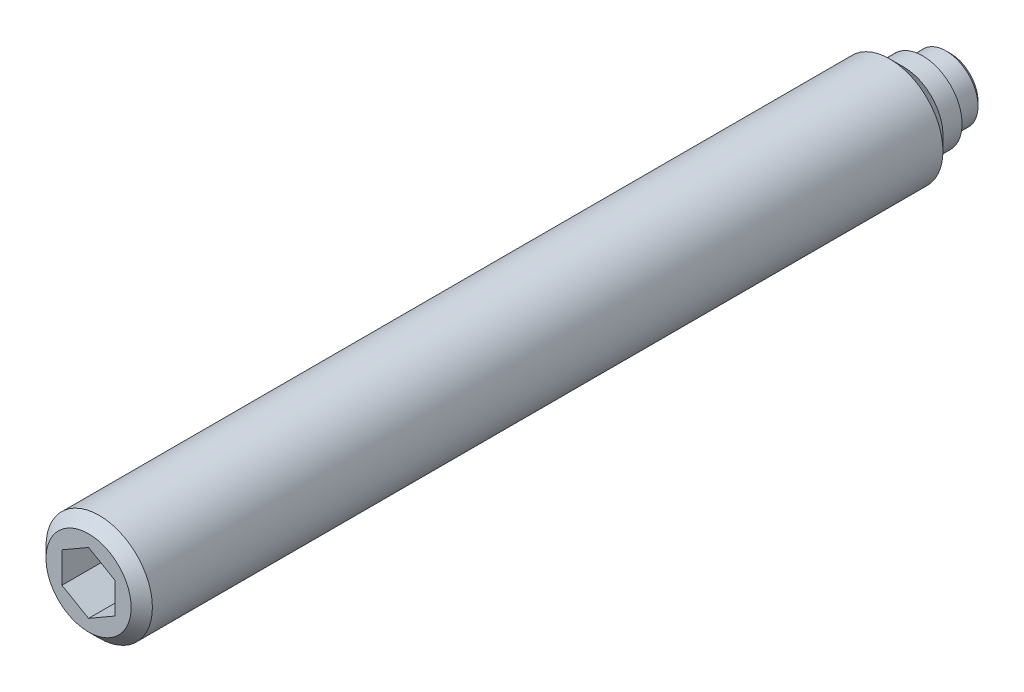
ISO-10303-21;
HEADER;
FILE_DESCRIPTION(('STEP AP214'),'2;1');
FILE_NAME('part.step','',(''),(''),'','','');
FILE_SCHEMA(('AUTOMOTIVE_DESIGN { 1 0 10303 214 1 1 1 1 }'));
ENDSEC;
DATA;
#1=APPLICATION_CONTEXT('core data for automotive mechanical design processes');
#2=APPLICATION_PROTOCOL_DEFINITION('international standard','automotive_design',2000,#1);
#3=PRODUCT_CONTEXT('',#1,'mechanical');
#4=PRODUCT('Part','Part','',(#3));
#5=PRODUCT_RELATED_PRODUCT_CATEGORY('part','',(#4));
#6=PRODUCT_DEFINITION_FORMATION('','',#4);
#7=PRODUCT_DEFINITION_CONTEXT('part definition',#1,'design');
#8=PRODUCT_DEFINITION('design','',#6,#7);
#9=PRODUCT_DEFINITION_SHAPE('','',#8);
#10=(LENGTH_UNIT() NAMED_UNIT(*) SI_UNIT(.MILLI.,.METRE.));
#11=(NAMED_UNIT(*) PLANE_ANGLE_UNIT() SI_UNIT($,.RADIAN.));
#12=(NAMED_UNIT(*) SI_UNIT($,.STERADIAN.) SOLID_ANGLE_UNIT());
#13=UNCERTAINTY_MEASURE_WITH_UNIT(LENGTH_MEASURE(1.E-05),#10,'distance_accuracy_value','');
#14=(GEOMETRIC_REPRESENTATION_CONTEXT(3) GLOBAL_UNCERTAINTY_ASSIGNED_CONTEXT((#13)) GLOBAL_UNIT_ASSIGNED_CONTEXT((#10,
#11,#12)) REPRESENTATION_CONTEXT('',''));
#15=CARTESIAN_POINT('',(0.,0.,0.));
#16=DIRECTION('',(0.,0.,1.));
#17=DIRECTION('',(1.,0.,0.));
#18=AXIS2_PLACEMENT_3D('',#15,#16,#17);
#19=CARTESIAN_POINT('',(0.,0.,1.3));
#20=DIRECTION('',(0.,0.,-1.));
#21=DIRECTION('',(-1.,0.,0.));
#22=AXIS2_PLACEMENT_3D('',#19,#20,#21);
#23=CYLINDRICAL_SURFACE('',#22,2.5);
#24=CARTESIAN_POINT('',(0.,0.,2.85));
#25=DIRECTION('',(0.,0.,-1.));
#26=DIRECTION('',(-1.,0.,0.));
#27=AXIS2_PLACEMENT_3D('',#24,#25,#26);
#28=CIRCLE('',#27,2.5);
#29=CARTESIAN_POINT('',(-2.5,0.,2.85));
#30=VERTEX_POINT('',#29);
#31=EDGE_CURVE('E9',#30,#30,#28,.T.);
#32=ORIENTED_EDGE('',*,*,#31,.F.);
#33=EDGE_LOOP('',(#32));
#34=FACE_BOUND('',#33,.T.);
#35=CARTESIAN_POINT('',(0.,0.,40.));
#36=DIRECTION('',(0.,0.,1.));
#37=DIRECTION('',(1.,0.,0.));
#38=AXIS2_PLACEMENT_3D('',#35,#36,#37);
#39=CIRCLE('',#38,2.5);
#40=CARTESIAN_POINT('',(2.5,0.,40.));
#41=VERTEX_POINT('',#40);
#42=EDGE_CURVE('E115',#41,#41,#39,.T.);
#43=ORIENTED_EDGE('',*,*,#42,.F.);
#44=EDGE_LOOP('',(#43));
#45=FACE_BOUND('',#44,.T.);
#46=ADVANCED_FACE('F14',(#34,#45),#23,.T.);
#47=CARTESIAN_POINT('',(0.,0.,2.85));
#48=DIRECTION('',(0.,0.,1.));
#49=DIRECTION('',(1.,0.,0.));
#50=AXIS2_PLACEMENT_3D('',#47,#48,#49);
#51=CONICAL_SURFACE('',#50,2.5,0.785398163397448);
#52=ORIENTED_EDGE('',*,*,#31,.T.);
#53=EDGE_LOOP('',(#52));
#54=FACE_BOUND('',#53,.T.);
#55=CARTESIAN_POINT('',(0.,0.,2.2));
#56=DIRECTION('',(0.,0.,-1.));
#57=DIRECTION('',(-1.,0.,0.));
#58=AXIS2_PLACEMENT_3D('',#55,#56,#57);
#59=CIRCLE('',#58,1.85);
#60=CARTESIAN_POINT('',(-1.85,0.,2.2));
#61=VERTEX_POINT('',#60);
#62=EDGE_CURVE('E21',#61,#61,#59,.T.);
#63=ORIENTED_EDGE('',*,*,#62,.F.);
#64=EDGE_LOOP('',(#63));
#65=FACE_BOUND('',#64,.T.);
#66=ADVANCED_FACE('F143',(#54,#65),#51,.T.);
#67=CARTESIAN_POINT('',(0.,0.,1.3));
#68=DIRECTION('',(0.,0.,-1.));
#69=DIRECTION('',(-1.,0.,0.));
#70=AXIS2_PLACEMENT_3D('',#67,#68,#69);
#71=CYLINDRICAL_SURFACE('',#70,1.85);
#72=ORIENTED_EDGE('',*,*,#62,.T.);
#73=EDGE_LOOP('',(#72));
#74=FACE_BOUND('',#73,.T.);
#75=CARTESIAN_POINT('',(0.,0.,1.3));
#76=DIRECTION('',(0.,0.,-1.));
#77=DIRECTION('',(-1.,0.,0.));
#78=AXIS2_PLACEMENT_3D('',#75,#76,#77);
#79=CIRCLE('',#78,1.85);
#80=CARTESIAN_POINT('',(-1.85,0.,1.3));
#81=VERTEX_POINT('',#80);
#82=EDGE_CURVE('E135',#81,#81,#79,.T.);
#83=ORIENTED_EDGE('',*,*,#82,.F.);
#84=EDGE_LOOP('',(#83));
#85=FACE_BOUND('',#84,.T.);
#86=ADVANCED_FACE('F140',(#74,#85),#71,.T.);
#87=CARTESIAN_POINT('',(0.,1.85,1.3));
#88=DIRECTION('',(0.,0.,1.));
#89=DIRECTION('',(1.,0.,0.));
#90=AXIS2_PLACEMENT_3D('',#87,#88,#89);
#91=PLANE('',#90);
#92=ORIENTED_EDGE('',*,*,#82,.T.);
#93=EDGE_LOOP('',(#92));
#94=FACE_BOUND('',#93,.T.);
#95=CARTESIAN_POINT('',(0.,0.,1.3));
#96=DIRECTION('',(0.,0.,-1.));
#97=DIRECTION('',(-1.,0.,0.));
#98=AXIS2_PLACEMENT_3D('',#95,#96,#97);
#99=CIRCLE('',#98,1.5);
#100=CARTESIAN_POINT('',(-1.5,0.,1.3));
#101=VERTEX_POINT('',#100);
#102=EDGE_CURVE('E132',#101,#101,#99,.T.);
#103=ORIENTED_EDGE('',*,*,#102,.F.);
#104=EDGE_LOOP('',(#103));
#105=FACE_BOUND('',#104,.T.);
#106=ADVANCED_FACE('F151',(#94,#105),#91,.F.);
#107=CARTESIAN_POINT('',(0.,0.,0.));
#108=DIRECTION('',(0.,0.,-1.));
#109=DIRECTION('',(-1.,0.,0.));
#110=AXIS2_PLACEMENT_3D('',#107,#108,#109);
#111=CYLINDRICAL_SURFACE('',#110,1.5);
#112=CARTESIAN_POINT('',(0.,0.,0.2));
#113=DIRECTION('',(0.,0.,-1.));
#114=DIRECTION('',(-1.,0.,0.));
#115=AXIS2_PLACEMENT_3D('',#112,#113,#114);
#116=CIRCLE('',#115,1.5);
#117=CARTESIAN_POINT('',(-1.5,0.,0.2));
#118=VERTEX_POINT('',#117);
#119=EDGE_CURVE('E129',#118,#118,#116,.T.);
#120=ORIENTED_EDGE('',*,*,#119,.F.);
#121=EDGE_LOOP('',(#120));
#122=FACE_BOUND('',#121,.T.);
#123=ORIENTED_EDGE('',*,*,#102,.T.);
#124=EDGE_LOOP('',(#123));
#125=FACE_BOUND('',#124,.T.);
#126=ADVANCED_FACE('F157',(#122,#125),#111,.T.);
#127=CARTESIAN_POINT('',(0.,0.,0.2));
#128=DIRECTION('',(0.,0.,1.));
#129=DIRECTION('',(1.,0.,0.));
#130=AXIS2_PLACEMENT_3D('',#127,#128,#129);
#131=CONICAL_SURFACE('',#130,1.5,0.785398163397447);
#132=CARTESIAN_POINT('',(0.,0.,0.));
#133=DIRECTION('',(0.,0.,-1.));
#134=DIRECTION('',(-1.,0.,0.));
#135=AXIS2_PLACEMENT_3D('',#132,#133,#134);
#136=CIRCLE('',#135,1.3);
#137=CARTESIAN_POINT('',(-1.3,0.,0.));
#138=VERTEX_POINT('',#137);
#139=EDGE_CURVE('E126',#138,#138,#136,.T.);
#140=ORIENTED_EDGE('',*,*,#139,.F.);
#141=EDGE_LOOP('',(#140));
#142=FACE_BOUND('',#141,.T.);
#143=ORIENTED_EDGE('',*,*,#119,.T.);
#144=EDGE_LOOP('',(#143));
#145=FACE_BOUND('',#144,.T.);
#146=ADVANCED_FACE('F161',(#142,#145),#131,.T.);
#147=CARTESIAN_POINT('',(0.,1.3,0.));
#148=DIRECTION('',(0.,0.,1.));
#149=DIRECTION('',(1.,0.,0.));
#150=AXIS2_PLACEMENT_3D('',#147,#148,#149);
#151=PLANE('',#150);
#152=ORIENTED_EDGE('',*,*,#139,.T.);
#153=EDGE_LOOP('',(#152));
#154=FACE_BOUND('',#153,.T.);
#155=ADVANCED_FACE('F165',(#154),#151,.F.);
#156=CARTESIAN_POINT('',(0.,0.,40.5));
#157=DIRECTION('',(0.,0.,1.));
#158=DIRECTION('',(1.,0.,0.));
#159=AXIS2_PLACEMENT_3D('',#156,#157,#158);
#160=PLANE('',#159);
#161=DIRECTION('',(0.866025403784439,-0.5,0.));
#162=VECTOR('',#161,1.);
#163=CARTESIAN_POINT('',(-1.25,-0.721687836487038,40.5));
#164=LINE('',#163,#162);
#165=CARTESIAN_POINT('',(-1.25,-0.721687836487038,40.5));
#166=VERTEX_POINT('',#165);
#167=CARTESIAN_POINT('',(0.,-1.44337567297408,40.5));
#168=VERTEX_POINT('',#167);
#169=EDGE_CURVE('E28',#166,#168,#164,.T.);
#170=ORIENTED_EDGE('',*,*,#169,.F.);
#171=DIRECTION('',(0.,-1.,0.));
#172=VECTOR('',#171,1.);
#173=CARTESIAN_POINT('',(-1.25,0.721687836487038,40.5));
#174=LINE('',#173,#172);
#175=CARTESIAN_POINT('',(-1.25,0.721687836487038,40.5));
#176=VERTEX_POINT('',#175);
#177=EDGE_CURVE('E111',#176,#166,#174,.T.);
#178=ORIENTED_EDGE('',*,*,#177,.F.);
#179=DIRECTION('',(-0.866025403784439,-0.5,0.));
#180=VECTOR('',#179,1.);
#181=CARTESIAN_POINT('',(0.,1.44337567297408,40.5));
#182=LINE('',#181,#180);
#183=CARTESIAN_POINT('',(0.,1.44337567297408,40.5));
#184=VERTEX_POINT('',#183);
#185=EDGE_CURVE('E109',#184,#176,#182,.T.);
#186=ORIENTED_EDGE('',*,*,#185,.F.);
#187=DIRECTION('',(-0.866025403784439,0.5,0.));
#188=VECTOR('',#187,1.);
#189=CARTESIAN_POINT('',(1.25,0.721687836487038,40.5));
#190=LINE('',#189,#188);
#191=CARTESIAN_POINT('',(1.25,0.721687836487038,40.5));
#192=VERTEX_POINT('',#191);
#193=EDGE_CURVE('E76',#192,#184,#190,.T.);
#194=ORIENTED_EDGE('',*,*,#193,.F.);
#195=DIRECTION('',(0.,1.,0.));
#196=VECTOR('',#195,1.);
#197=CARTESIAN_POINT('',(1.25,-0.721687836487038,40.5));
#198=LINE('',#197,#196);
#199=CARTESIAN_POINT('',(1.25,-0.721687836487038,40.5));
#200=VERTEX_POINT('',#199);
#201=EDGE_CURVE('E105',#200,#192,#198,.T.);
#202=ORIENTED_EDGE('',*,*,#201,.F.);
#203=DIRECTION('',(0.866025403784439,0.5,0.));
#204=VECTOR('',#203,1.);
#205=CARTESIAN_POINT('',(0.,-1.44337567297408,40.5));
#206=LINE('',#205,#204);
#207=EDGE_CURVE('E102',#168,#200,#206,.T.);
#208=ORIENTED_EDGE('',*,*,#207,.F.);
#209=EDGE_LOOP('',(#170,#178,#186,#194,#202,#208));
#210=FACE_BOUND('',#209,.T.);
#211=CARTESIAN_POINT('',(0.,0.,40.5));
#212=DIRECTION('',(0.,0.,1.));
#213=DIRECTION('',(1.,0.,0.));
#214=AXIS2_PLACEMENT_3D('',#211,#212,#213);
#215=CIRCLE('',#214,2.);
#216=CARTESIAN_POINT('',(2.,0.,40.5));
#217=VERTEX_POINT('',#216);
#218=EDGE_CURVE('E123',#217,#217,#215,.T.);
#219=ORIENTED_EDGE('',*,*,#218,.T.);
#220=EDGE_LOOP('',(#219));
#221=FACE_BOUND('',#220,.T.);
#222=ADVANCED_FACE('F169',(#210,#221),#160,.T.);
#223=CARTESIAN_POINT('',(0.,0.,40.5));
#224=DIRECTION('',(0.,0.,-1.));
#225=DIRECTION('',(-1.,0.,0.));
#226=AXIS2_PLACEMENT_3D('',#223,#224,#225);
#227=CONICAL_SURFACE('',#226,2.,0.785398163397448);
#228=ORIENTED_EDGE('',*,*,#42,.T.);
#229=EDGE_LOOP('',(#228));
#230=FACE_BOUND('',#229,.T.);
#231=ORIENTED_EDGE('',*,*,#218,.F.);
#232=EDGE_LOOP('',(#231));
#233=FACE_BOUND('',#232,.T.);
#234=ADVANCED_FACE('F173',(#230,#233),#227,.T.);
#235=CARTESIAN_POINT('',(-1.25,-0.721687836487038,37.5));
#236=DIRECTION('',(-0.5,-0.866025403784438,0.));
#237=DIRECTION('',(0.866025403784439,-0.5,0.));
#238=AXIS2_PLACEMENT_3D('',#235,#236,#237);
#239=PLANE('',#238);
#240=ORIENTED_EDGE('',*,*,#169,.T.);
#241=DIRECTION('',(0.,0.,1.));
#242=VECTOR('',#241,1.);
#243=CARTESIAN_POINT('',(0.,-1.44337567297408,37.5));
#244=LINE('',#243,#242);
#245=CARTESIAN_POINT('',(0.,-1.44337567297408,37.5));
#246=VERTEX_POINT('',#245);
#247=EDGE_CURVE('E58',#246,#168,#244,.T.);
#248=ORIENTED_EDGE('',*,*,#247,.F.);
#249=DIRECTION('',(0.866025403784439,-0.5,0.));
#250=VECTOR('',#249,1.);
#251=CARTESIAN_POINT('',(-1.25,-0.721687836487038,37.5));
#252=LINE('',#251,#250);
#253=CARTESIAN_POINT('',(-1.25,-0.721687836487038,37.5));
#254=VERTEX_POINT('',#253);
#255=EDGE_CURVE('E113',#254,#246,#252,.T.);
#256=ORIENTED_EDGE('',*,*,#255,.F.);
#257=DIRECTION('',(0.,0.,1.));
#258=VECTOR('',#257,1.);
#259=CARTESIAN_POINT('',(-1.25,-0.721687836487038,37.5));
#260=LINE('',#259,#258);
#261=EDGE_CURVE('E36',#254,#166,#260,.T.);
#262=ORIENTED_EDGE('',*,*,#261,.T.);
#263=EDGE_LOOP('',(#240,#248,#256,#262));
#264=FACE_BOUND('',#263,.T.);
#265=ADVANCED_FACE('F177',(#264),#239,.F.);
#266=CARTESIAN_POINT('',(-1.25,0.721687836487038,37.5));
#267=DIRECTION('',(-1.,0.,0.));
#268=DIRECTION('',(0.,0.,1.));
#269=AXIS2_PLACEMENT_3D('',#266,#267,#268);
#270=PLANE('',#269);
#271=ORIENTED_EDGE('',*,*,#177,.T.);
#272=ORIENTED_EDGE('',*,*,#261,.F.);
#273=DIRECTION('',(0.,-1.,0.));
#274=VECTOR('',#273,1.);
#275=CARTESIAN_POINT('',(-1.25,0.721687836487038,37.5));
#276=LINE('',#275,#274);
#277=CARTESIAN_POINT('',(-1.25,0.721687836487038,37.5));
#278=VERTEX_POINT('',#277);
#279=EDGE_CURVE('E88',#278,#254,#276,.T.);
#280=ORIENTED_EDGE('',*,*,#279,.F.);
#281=DIRECTION('',(0.,0.,1.));
#282=VECTOR('',#281,1.);
#283=CARTESIAN_POINT('',(-1.25,0.721687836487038,37.5));
#284=LINE('',#283,#282);
#285=EDGE_CURVE('E80',#278,#176,#284,.T.);
#286=ORIENTED_EDGE('',*,*,#285,.T.);
#287=EDGE_LOOP('',(#271,#272,#280,#286));
#288=FACE_BOUND('',#287,.T.);
#289=ADVANCED_FACE('F181',(#288),#270,.F.);
#290=CARTESIAN_POINT('',(0.,1.44337567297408,37.5));
#291=DIRECTION('',(-0.5,0.866025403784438,0.));
#292=DIRECTION('',(-0.866025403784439,-0.5,0.));
#293=AXIS2_PLACEMENT_3D('',#290,#291,#292);
#294=PLANE('',#293);
#295=ORIENTED_EDGE('',*,*,#185,.T.);
#296=ORIENTED_EDGE('',*,*,#285,.F.);
#297=DIRECTION('',(-0.866025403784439,-0.5,0.));
#298=VECTOR('',#297,1.);
#299=CARTESIAN_POINT('',(0.,1.44337567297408,37.5));
#300=LINE('',#299,#298);
#301=CARTESIAN_POINT('',(0.,1.44337567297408,37.5));
#302=VERTEX_POINT('',#301);
#303=EDGE_CURVE('E84',#302,#278,#300,.T.);
#304=ORIENTED_EDGE('',*,*,#303,.F.);
#305=DIRECTION('',(0.,0.,1.));
#306=VECTOR('',#305,1.);
#307=CARTESIAN_POINT('',(0.,1.44337567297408,37.5));
#308=LINE('',#307,#306);
#309=EDGE_CURVE('E69',#302,#184,#308,.T.);
#310=ORIENTED_EDGE('',*,*,#309,.T.);
#311=EDGE_LOOP('',(#295,#296,#304,#310));
#312=FACE_BOUND('',#311,.T.);
#313=ADVANCED_FACE('F85',(#312),#294,.F.);
#314=CARTESIAN_POINT('',(1.25,0.721687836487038,37.5));
#315=DIRECTION('',(0.5,0.866025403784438,0.));
#316=DIRECTION('',(-0.866025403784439,0.5,0.));
#317=AXIS2_PLACEMENT_3D('',#314,#315,#316);
#318=PLANE('',#317);
#319=ORIENTED_EDGE('',*,*,#193,.T.);
#320=ORIENTED_EDGE('',*,*,#309,.F.);
#321=DIRECTION('',(-0.866025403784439,0.5,0.));
#322=VECTOR('',#321,1.);
#323=CARTESIAN_POINT('',(1.25,0.721687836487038,37.5));
#324=LINE('',#323,#322);
#325=CARTESIAN_POINT('',(1.25,0.721687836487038,37.5));
#326=VERTEX_POINT('',#325);
#327=EDGE_CURVE('E73',#326,#302,#324,.T.);
#328=ORIENTED_EDGE('',*,*,#327,.F.);
#329=DIRECTION('',(0.,0.,1.));
#330=VECTOR('',#329,1.);
#331=CARTESIAN_POINT('',(1.25,0.721687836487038,37.5));
#332=LINE('',#331,#330);
#333=EDGE_CURVE('E81',#326,#192,#332,.T.);
#334=ORIENTED_EDGE('',*,*,#333,.T.);
#335=EDGE_LOOP('',(#319,#320,#328,#334));
#336=FACE_BOUND('',#335,.T.);
#337=ADVANCED_FACE('F71',(#336),#318,.F.);
#338=CARTESIAN_POINT('',(1.25,-0.721687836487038,37.5));
#339=DIRECTION('',(1.,0.,0.));
#340=DIRECTION('',(0.,0.,-1.));
#341=AXIS2_PLACEMENT_3D('',#338,#339,#340);
#342=PLANE('',#341);
#343=ORIENTED_EDGE('',*,*,#201,.T.);
#344=ORIENTED_EDGE('',*,*,#333,.F.);
#345=DIRECTION('',(0.,1.,0.));
#346=VECTOR('',#345,1.);
#347=CARTESIAN_POINT('',(1.25,-0.721687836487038,37.5));
#348=LINE('',#347,#346);
#349=CARTESIAN_POINT('',(1.25,-0.721687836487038,37.5));
#350=VERTEX_POINT('',#349);
#351=EDGE_CURVE('E94',#350,#326,#348,.T.);
#352=ORIENTED_EDGE('',*,*,#351,.F.);
#353=DIRECTION('',(0.,0.,1.));
#354=VECTOR('',#353,1.);
#355=CARTESIAN_POINT('',(1.25,-0.721687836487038,37.5));
#356=LINE('',#355,#354);
#357=EDGE_CURVE('E118',#350,#200,#356,.T.);
#358=ORIENTED_EDGE('',*,*,#357,.T.);
#359=EDGE_LOOP('',(#343,#344,#352,#358));
#360=FACE_BOUND('',#359,.T.);
#361=ADVANCED_FACE('F185',(#360),#342,.F.);
#362=CARTESIAN_POINT('',(0.,-1.44337567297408,37.5));
#363=DIRECTION('',(0.5,-0.866025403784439,0.));
#364=DIRECTION('',(0.866025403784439,0.5,0.));
#365=AXIS2_PLACEMENT_3D('',#362,#363,#364);
#366=PLANE('',#365);
#367=ORIENTED_EDGE('',*,*,#207,.T.);
#368=ORIENTED_EDGE('',*,*,#357,.F.);
#369=DIRECTION('',(0.866025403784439,0.5,0.));
#370=VECTOR('',#369,1.);
#371=CARTESIAN_POINT('',(0.,-1.44337567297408,37.5));
#372=LINE('',#371,#370);
#373=EDGE_CURVE('E96',#246,#350,#372,.T.);
#374=ORIENTED_EDGE('',*,*,#373,.F.);
#375=ORIENTED_EDGE('',*,*,#247,.T.);
#376=EDGE_LOOP('',(#367,#368,#374,#375));
#377=FACE_BOUND('',#376,.T.);
#378=ADVANCED_FACE('F182',(#377),#366,.F.);
#379=CARTESIAN_POINT('',(0.,0.,37.5));
#380=DIRECTION('',(0.,0.,1.));
#381=DIRECTION('',(1.,0.,0.));
#382=AXIS2_PLACEMENT_3D('',#379,#380,#381);
#383=PLANE('',#382);
#384=ORIENTED_EDGE('',*,*,#255,.T.);
#385=ORIENTED_EDGE('',*,*,#373,.T.);
#386=ORIENTED_EDGE('',*,*,#351,.T.);
#387=ORIENTED_EDGE('',*,*,#327,.T.);
#388=ORIENTED_EDGE('',*,*,#303,.T.);
#389=ORIENTED_EDGE('',*,*,#279,.T.);
#390=EDGE_LOOP('',(#384,#385,#386,#387,#388,#389));
#391=FACE_BOUND('',#390,.T.);
#392=ADVANCED_FACE('F91',(#391),#383,.T.);
#393=CLOSED_SHELL('',(#46,#66,#86,#106,#126,#146,#155,#222,#234,#265,#289,#313,#337,#361,#378,#392));
#394=MANIFOLD_SOLID_BREP('B1',#393);
#395=ADVANCED_BREP_SHAPE_REPRESENTATION('',(#18,#394),#14);
#396=SHAPE_DEFINITION_REPRESENTATION(#9,#395);
ENDSEC;
END-ISO-10303-21;
